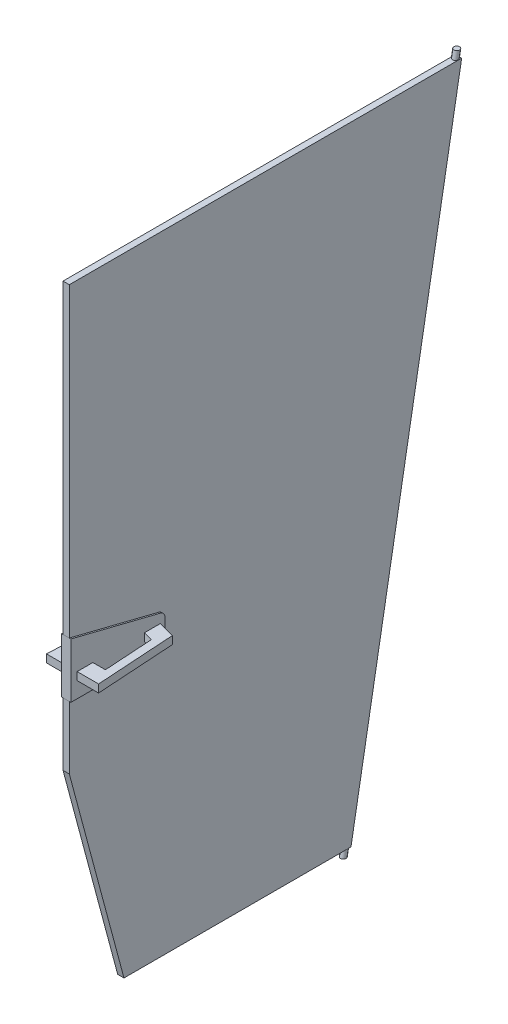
ISO-10303-21;
HEADER;
FILE_DESCRIPTION(('STEP AP214'),'2;1');
FILE_NAME('part.step','',(''),(''),'','','');
FILE_SCHEMA(('AUTOMOTIVE_DESIGN { 1 0 10303 214 1 1 1 1 }'));
ENDSEC;
DATA;
#1=APPLICATION_CONTEXT('core data for automotive mechanical design processes');
#2=APPLICATION_PROTOCOL_DEFINITION('international standard','automotive_design',2000,#1);
#3=PRODUCT_CONTEXT('',#1,'mechanical');
#4=PRODUCT('Part','Part','',(#3));
#5=PRODUCT_RELATED_PRODUCT_CATEGORY('part','',(#4));
#6=PRODUCT_DEFINITION_FORMATION('','',#4);
#7=PRODUCT_DEFINITION_CONTEXT('part definition',#1,'design');
#8=PRODUCT_DEFINITION('design','',#6,#7);
#9=PRODUCT_DEFINITION_SHAPE('','',#8);
#10=(LENGTH_UNIT() NAMED_UNIT(*) SI_UNIT(.MILLI.,.METRE.));
#11=(NAMED_UNIT(*) PLANE_ANGLE_UNIT() SI_UNIT($,.RADIAN.));
#12=(NAMED_UNIT(*) SI_UNIT($,.STERADIAN.) SOLID_ANGLE_UNIT());
#13=UNCERTAINTY_MEASURE_WITH_UNIT(LENGTH_MEASURE(1.E-05),#10,'distance_accuracy_value','');
#14=(GEOMETRIC_REPRESENTATION_CONTEXT(3) GLOBAL_UNCERTAINTY_ASSIGNED_CONTEXT((#13)) GLOBAL_UNIT_ASSIGNED_CONTEXT((#10,
#11,#12)) REPRESENTATION_CONTEXT('',''));
#15=CARTESIAN_POINT('',(0.,0.,0.));
#16=DIRECTION('',(0.,0.,1.));
#17=DIRECTION('',(1.,0.,0.));
#18=AXIS2_PLACEMENT_3D('',#15,#16,#17);
#19=CARTESIAN_POINT('',(-65.,925.,827.39));
#20=DIRECTION('',(-0.997972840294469,0.,-0.063641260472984));
#21=DIRECTION('',(-0.0636412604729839,0.,0.997972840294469));
#22=AXIS2_PLACEMENT_3D('',#19,#20,#21);
#23=PLANE('',#22);
#24=DIRECTION('',(0.0636412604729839,0.,-0.997972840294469));
#25=VECTOR('',#24,1.);
#26=CARTESIAN_POINT('',(-65.,900.,827.39));
#27=LINE('',#26,#25);
#28=CARTESIAN_POINT('',(-65.,900.,827.39));
#29=VERTEX_POINT('',#28);
#30=CARTESIAN_POINT('',(-55.,900.,670.577763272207));
#31=VERTEX_POINT('',#30);
#32=EDGE_CURVE('E12',#29,#31,#27,.T.);
#33=ORIENTED_EDGE('',*,*,#32,.T.);
#34=DIRECTION('',(0.,-1.,0.));
#35=VECTOR('',#34,1.);
#36=CARTESIAN_POINT('',(-55.,925.,670.577763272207));
#37=LINE('',#36,#35);
#38=CARTESIAN_POINT('',(-55.,925.,670.577763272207));
#39=VERTEX_POINT('',#38);
#40=EDGE_CURVE('E187',#39,#31,#37,.T.);
#41=ORIENTED_EDGE('',*,*,#40,.F.);
#42=DIRECTION('',(0.0636412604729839,0.,-0.997972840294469));
#43=VECTOR('',#42,1.);
#44=CARTESIAN_POINT('',(-65.,925.,827.39));
#45=LINE('',#44,#43);
#46=CARTESIAN_POINT('',(-65.,925.,827.39));
#47=VERTEX_POINT('',#46);
#48=EDGE_CURVE('E55',#47,#39,#45,.T.);
#49=ORIENTED_EDGE('',*,*,#48,.F.);
#50=DIRECTION('',(0.,-1.,0.));
#51=VECTOR('',#50,1.);
#52=CARTESIAN_POINT('',(-65.,925.,827.39));
#53=LINE('',#52,#51);
#54=EDGE_CURVE('E155',#47,#29,#53,.T.);
#55=ORIENTED_EDGE('',*,*,#54,.T.);
#56=EDGE_LOOP('',(#33,#41,#49,#55));
#57=FACE_BOUND('',#56,.T.);
#58=ADVANCED_FACE('F51',(#57),#23,.F.);
#59=CARTESIAN_POINT('',(-55.,925.,670.577763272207));
#60=DIRECTION('',(-0.258819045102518,0.,-0.965925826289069));
#61=DIRECTION('',(-0.965925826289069,0.,0.258819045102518));
#62=AXIS2_PLACEMENT_3D('',#59,#60,#61);
#63=PLANE('',#62);
#64=DIRECTION('',(0.965925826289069,0.,-0.258819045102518));
#65=VECTOR('',#64,1.);
#66=CARTESIAN_POINT('',(-55.,900.,670.577763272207));
#67=LINE('',#66,#65);
#68=CARTESIAN_POINT('',(-25.,900.,662.539287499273));
#69=VERTEX_POINT('',#68);
#70=EDGE_CURVE('E61',#31,#69,#67,.T.);
#71=ORIENTED_EDGE('',*,*,#70,.T.);
#72=DIRECTION('',(0.,-1.,0.));
#73=VECTOR('',#72,1.);
#74=CARTESIAN_POINT('',(-25.,925.,662.539287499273));
#75=LINE('',#74,#73);
#76=CARTESIAN_POINT('',(-25.,925.,662.539287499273));
#77=VERTEX_POINT('',#76);
#78=EDGE_CURVE('E131',#77,#69,#75,.T.);
#79=ORIENTED_EDGE('',*,*,#78,.F.);
#80=DIRECTION('',(0.965925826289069,0.,-0.258819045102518));
#81=VECTOR('',#80,1.);
#82=CARTESIAN_POINT('',(-55.,925.,670.577763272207));
#83=LINE('',#82,#81);
#84=EDGE_CURVE('E97',#39,#77,#83,.T.);
#85=ORIENTED_EDGE('',*,*,#84,.F.);
#86=ORIENTED_EDGE('',*,*,#40,.T.);
#87=EDGE_LOOP('',(#71,#79,#85,#86));
#88=FACE_BOUND('',#87,.T.);
#89=ADVANCED_FACE('F193',(#88),#63,.F.);
#90=CARTESIAN_POINT('',(-25.,925.,662.539287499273));
#91=DIRECTION('',(-1.,0.,0.));
#92=DIRECTION('',(0.,0.,1.));
#93=AXIS2_PLACEMENT_3D('',#90,#91,#92);
#94=PLANE('',#93);
#95=DIRECTION('',(0.,0.,-1.));
#96=VECTOR('',#95,1.);
#97=CARTESIAN_POINT('',(-25.,900.,662.539287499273));
#98=LINE('',#97,#96);
#99=CARTESIAN_POINT('',(-25.,900.,612.539287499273));
#100=VERTEX_POINT('',#99);
#101=EDGE_CURVE('E125',#69,#100,#98,.T.);
#102=ORIENTED_EDGE('',*,*,#101,.T.);
#103=DIRECTION('',(0.,-1.,0.));
#104=VECTOR('',#103,1.);
#105=CARTESIAN_POINT('',(-25.,925.,612.539287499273));
#106=LINE('',#105,#104);
#107=CARTESIAN_POINT('',(-25.,925.,612.539287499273));
#108=VERTEX_POINT('',#107);
#109=EDGE_CURVE('E129',#108,#100,#106,.T.);
#110=ORIENTED_EDGE('',*,*,#109,.F.);
#111=DIRECTION('',(0.,0.,-1.));
#112=VECTOR('',#111,1.);
#113=CARTESIAN_POINT('',(-25.,925.,662.539287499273));
#114=LINE('',#113,#112);
#115=EDGE_CURVE('E162',#77,#108,#114,.T.);
#116=ORIENTED_EDGE('',*,*,#115,.F.);
#117=ORIENTED_EDGE('',*,*,#78,.T.);
#118=EDGE_LOOP('',(#102,#110,#116,#117));
#119=FACE_BOUND('',#118,.T.);
#120=ADVANCED_FACE('F127',(#119),#94,.F.);
#121=CARTESIAN_POINT('',(-25.,925.,612.539287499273));
#122=DIRECTION('',(0.258819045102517,0.,0.965925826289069));
#123=DIRECTION('',(0.96592582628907,0.,-0.258819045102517));
#124=AXIS2_PLACEMENT_3D('',#121,#122,#123);
#125=PLANE('',#124);
#126=DIRECTION('',(-0.965925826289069,0.,0.258819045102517));
#127=VECTOR('',#126,1.);
#128=CARTESIAN_POINT('',(-25.,900.,612.539287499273));
#129=LINE('',#128,#127);
#130=CARTESIAN_POINT('',(-77.2423155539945,900.,626.537573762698));
#131=VERTEX_POINT('',#130);
#132=EDGE_CURVE('E133',#100,#131,#129,.T.);
#133=ORIENTED_EDGE('',*,*,#132,.T.);
#134=DIRECTION('',(0.,-1.,0.));
#135=VECTOR('',#134,1.);
#136=CARTESIAN_POINT('',(-77.2423155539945,925.,626.537573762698));
#137=LINE('',#136,#135);
#138=CARTESIAN_POINT('',(-77.2423155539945,925.,626.537573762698));
#139=VERTEX_POINT('',#138);
#140=EDGE_CURVE('E140',#139,#131,#137,.T.);
#141=ORIENTED_EDGE('',*,*,#140,.F.);
#142=DIRECTION('',(-0.965925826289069,0.,0.258819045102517));
#143=VECTOR('',#142,1.);
#144=CARTESIAN_POINT('',(-25.,925.,612.539287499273));
#145=LINE('',#144,#143);
#146=EDGE_CURVE('E139',#108,#139,#145,.T.);
#147=ORIENTED_EDGE('',*,*,#146,.F.);
#148=ORIENTED_EDGE('',*,*,#109,.T.);
#149=EDGE_LOOP('',(#133,#141,#147,#148));
#150=FACE_BOUND('',#149,.T.);
#151=ADVANCED_FACE('F136',(#150),#125,.F.);
#152=CARTESIAN_POINT('',(-77.2423155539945,925.,626.537573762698));
#153=DIRECTION('',(0.997972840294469,0.,0.063641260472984));
#154=DIRECTION('',(0.063641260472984,0.,-0.997972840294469));
#155=AXIS2_PLACEMENT_3D('',#152,#153,#154);
#156=PLANE('',#155);
#157=DIRECTION('',(-0.063641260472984,0.,0.997972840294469));
#158=VECTOR('',#157,1.);
#159=CARTESIAN_POINT('',(-77.2423155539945,900.,626.537573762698));
#160=LINE('',#159,#158);
#161=CARTESIAN_POINT('',(-93.2393086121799,900.,877.39));
#162=VERTEX_POINT('',#161);
#163=EDGE_CURVE('E145',#131,#162,#160,.T.);
#164=ORIENTED_EDGE('',*,*,#163,.T.);
#165=DIRECTION('',(0.,-1.,0.));
#166=VECTOR('',#165,1.);
#167=CARTESIAN_POINT('',(-93.2393086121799,925.,877.39));
#168=LINE('',#167,#166);
#169=CARTESIAN_POINT('',(-93.2393086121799,925.,877.39));
#170=VERTEX_POINT('',#169);
#171=EDGE_CURVE('E179',#170,#162,#168,.T.);
#172=ORIENTED_EDGE('',*,*,#171,.F.);
#173=DIRECTION('',(-0.063641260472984,0.,0.997972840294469));
#174=VECTOR('',#173,1.);
#175=CARTESIAN_POINT('',(-77.2423155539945,925.,626.537573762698));
#176=LINE('',#175,#174);
#177=EDGE_CURVE('E159',#139,#170,#176,.T.);
#178=ORIENTED_EDGE('',*,*,#177,.F.);
#179=ORIENTED_EDGE('',*,*,#140,.T.);
#180=EDGE_LOOP('',(#164,#172,#178,#179));
#181=FACE_BOUND('',#180,.T.);
#182=ADVANCED_FACE('F196',(#181),#156,.F.);
#183=CARTESIAN_POINT('',(-93.2393086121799,925.,877.39));
#184=DIRECTION('',(0.,0.,-1.));
#185=DIRECTION('',(-1.,0.,0.));
#186=AXIS2_PLACEMENT_3D('',#183,#184,#185);
#187=PLANE('',#186);
#188=DIRECTION('',(1.,0.,0.));
#189=VECTOR('',#188,1.);
#190=CARTESIAN_POINT('',(-93.2393086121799,900.,877.39));
#191=LINE('',#190,#189);
#192=CARTESIAN_POINT('',(-25.,900.,877.39));
#193=VERTEX_POINT('',#192);
#194=EDGE_CURVE('E147',#162,#193,#191,.T.);
#195=ORIENTED_EDGE('',*,*,#194,.T.);
#196=DIRECTION('',(0.,-1.,0.));
#197=VECTOR('',#196,1.);
#198=CARTESIAN_POINT('',(-25.,925.,877.39));
#199=LINE('',#198,#197);
#200=CARTESIAN_POINT('',(-25.,925.,877.39));
#201=VERTEX_POINT('',#200);
#202=EDGE_CURVE('E176',#201,#193,#199,.T.);
#203=ORIENTED_EDGE('',*,*,#202,.F.);
#204=DIRECTION('',(1.,0.,0.));
#205=VECTOR('',#204,1.);
#206=CARTESIAN_POINT('',(-93.2393086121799,925.,877.39));
#207=LINE('',#206,#205);
#208=EDGE_CURVE('E157',#170,#201,#207,.T.);
#209=ORIENTED_EDGE('',*,*,#208,.F.);
#210=ORIENTED_EDGE('',*,*,#171,.T.);
#211=EDGE_LOOP('',(#195,#203,#209,#210));
#212=FACE_BOUND('',#211,.T.);
#213=ADVANCED_FACE('F174',(#212),#187,.F.);
#214=CARTESIAN_POINT('',(-25.,925.,877.39));
#215=DIRECTION('',(-1.,0.,0.));
#216=DIRECTION('',(0.,0.,1.));
#217=AXIS2_PLACEMENT_3D('',#214,#215,#216);
#218=PLANE('',#217);
#219=DIRECTION('',(0.,0.,-1.));
#220=VECTOR('',#219,1.);
#221=CARTESIAN_POINT('',(-25.,900.,877.39));
#222=LINE('',#221,#220);
#223=CARTESIAN_POINT('',(-25.,900.,827.39));
#224=VERTEX_POINT('',#223);
#225=EDGE_CURVE('E165',#193,#224,#222,.T.);
#226=ORIENTED_EDGE('',*,*,#225,.T.);
#227=DIRECTION('',(0.,-1.,0.));
#228=VECTOR('',#227,1.);
#229=CARTESIAN_POINT('',(-25.,925.,827.39));
#230=LINE('',#229,#228);
#231=CARTESIAN_POINT('',(-25.,925.,827.39));
#232=VERTEX_POINT('',#231);
#233=EDGE_CURVE('E184',#232,#224,#230,.T.);
#234=ORIENTED_EDGE('',*,*,#233,.F.);
#235=DIRECTION('',(0.,0.,-1.));
#236=VECTOR('',#235,1.);
#237=CARTESIAN_POINT('',(-25.,925.,877.39));
#238=LINE('',#237,#236);
#239=EDGE_CURVE('E154',#201,#232,#238,.T.);
#240=ORIENTED_EDGE('',*,*,#239,.F.);
#241=ORIENTED_EDGE('',*,*,#202,.T.);
#242=EDGE_LOOP('',(#226,#234,#240,#241));
#243=FACE_BOUND('',#242,.T.);
#244=ADVANCED_FACE('F182',(#243),#218,.F.);
#245=CARTESIAN_POINT('',(-25.,925.,827.39));
#246=DIRECTION('',(0.,0.,1.));
#247=DIRECTION('',(1.,0.,0.));
#248=AXIS2_PLACEMENT_3D('',#245,#246,#247);
#249=PLANE('',#248);
#250=DIRECTION('',(-1.,0.,0.));
#251=VECTOR('',#250,1.);
#252=CARTESIAN_POINT('',(-25.,900.,827.39));
#253=LINE('',#252,#251);
#254=EDGE_CURVE('E108',#224,#29,#253,.T.);
#255=ORIENTED_EDGE('',*,*,#254,.T.);
#256=ORIENTED_EDGE('',*,*,#54,.F.);
#257=DIRECTION('',(-1.,0.,0.));
#258=VECTOR('',#257,1.);
#259=CARTESIAN_POINT('',(-25.,925.,827.39));
#260=LINE('',#259,#258);
#261=EDGE_CURVE('E152',#232,#47,#260,.T.);
#262=ORIENTED_EDGE('',*,*,#261,.F.);
#263=ORIENTED_EDGE('',*,*,#233,.T.);
#264=EDGE_LOOP('',(#255,#256,#262,#263));
#265=FACE_BOUND('',#264,.T.);
#266=ADVANCED_FACE('F197',(#265),#249,.F.);
#267=CARTESIAN_POINT('',(0.,925.,0.));
#268=DIRECTION('',(0.,-1.,0.));
#269=DIRECTION('',(0.,0.,-1.));
#270=AXIS2_PLACEMENT_3D('',#267,#268,#269);
#271=PLANE('',#270);
#272=ORIENTED_EDGE('',*,*,#48,.T.);
#273=ORIENTED_EDGE('',*,*,#84,.T.);
#274=ORIENTED_EDGE('',*,*,#115,.T.);
#275=ORIENTED_EDGE('',*,*,#146,.T.);
#276=ORIENTED_EDGE('',*,*,#177,.T.);
#277=ORIENTED_EDGE('',*,*,#208,.T.);
#278=ORIENTED_EDGE('',*,*,#239,.T.);
#279=ORIENTED_EDGE('',*,*,#261,.T.);
#280=EDGE_LOOP('',(#272,#273,#274,#275,#276,#277,#278,#279));
#281=FACE_BOUND('',#280,.T.);
#282=ADVANCED_FACE('F53',(#281),#271,.F.);
#283=CARTESIAN_POINT('',(0.,900.,0.));
#284=DIRECTION('',(0.,-1.,0.));
#285=DIRECTION('',(0.,0.,-1.));
#286=AXIS2_PLACEMENT_3D('',#283,#284,#285);
#287=PLANE('',#286);
#288=ORIENTED_EDGE('',*,*,#32,.F.);
#289=ORIENTED_EDGE('',*,*,#254,.F.);
#290=ORIENTED_EDGE('',*,*,#225,.F.);
#291=ORIENTED_EDGE('',*,*,#194,.F.);
#292=ORIENTED_EDGE('',*,*,#163,.F.);
#293=ORIENTED_EDGE('',*,*,#132,.F.);
#294=ORIENTED_EDGE('',*,*,#101,.F.);
#295=ORIENTED_EDGE('',*,*,#70,.F.);
#296=EDGE_LOOP('',(#288,#289,#290,#291,#292,#293,#294,#295));
#297=FACE_BOUND('',#296,.T.);
#298=ADVANCED_FACE('F143',(#297),#287,.T.);
#299=CLOSED_SHELL('',(#58,#89,#120,#151,#182,#213,#244,#266,#282,#298));
#300=MANIFOLD_SOLID_BREP('B2',#299);
#301=CARTESIAN_POINT('',(35.,925.,670.577763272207));
#302=DIRECTION('',(0.258819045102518,0.,-0.965925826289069));
#303=DIRECTION('',(-0.965925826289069,0.,-0.258819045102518));
#304=AXIS2_PLACEMENT_3D('',#301,#302,#303);
#305=PLANE('',#304);
#306=DIRECTION('',(0.965925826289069,0.,0.258819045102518));
#307=VECTOR('',#306,1.);
#308=CARTESIAN_POINT('',(35.,900.,670.577763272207));
#309=LINE('',#308,#307);
#310=CARTESIAN_POINT('',(5.,900.,662.539287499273));
#311=VERTEX_POINT('',#310);
#312=CARTESIAN_POINT('',(35.,900.,670.577763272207));
#313=VERTEX_POINT('',#312);
#314=EDGE_CURVE('E404',#311,#313,#309,.T.);
#315=ORIENTED_EDGE('',*,*,#314,.T.);
#316=DIRECTION('',(0.,-1.,0.));
#317=VECTOR('',#316,1.);
#318=CARTESIAN_POINT('',(35.,925.,670.577763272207));
#319=LINE('',#318,#317);
#320=CARTESIAN_POINT('',(35.,925.,670.577763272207));
#321=VERTEX_POINT('',#320);
#322=EDGE_CURVE('E49',#321,#313,#319,.T.);
#323=ORIENTED_EDGE('',*,*,#322,.F.);
#324=DIRECTION('',(0.965925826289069,0.,0.258819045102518));
#325=VECTOR('',#324,1.);
#326=CARTESIAN_POINT('',(35.,925.,670.577763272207));
#327=LINE('',#326,#325);
#328=CARTESIAN_POINT('',(5.,925.,662.539287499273));
#329=VERTEX_POINT('',#328);
#330=EDGE_CURVE('E418',#329,#321,#327,.T.);
#331=ORIENTED_EDGE('',*,*,#330,.F.);
#332=DIRECTION('',(0.,-1.,0.));
#333=VECTOR('',#332,1.);
#334=CARTESIAN_POINT('',(5.,925.,662.539287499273));
#335=LINE('',#334,#333);
#336=EDGE_CURVE('E400',#329,#311,#335,.T.);
#337=ORIENTED_EDGE('',*,*,#336,.T.);
#338=EDGE_LOOP('',(#315,#323,#331,#337));
#339=FACE_BOUND('',#338,.T.);
#340=ADVANCED_FACE('F308',(#339),#305,.F.);
#341=CARTESIAN_POINT('',(45.,925.,827.39));
#342=DIRECTION('',(0.997972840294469,0.,-0.0636412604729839));
#343=DIRECTION('',(-0.0636412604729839,0.,-0.997972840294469));
#344=AXIS2_PLACEMENT_3D('',#341,#342,#343);
#345=PLANE('',#344);
#346=DIRECTION('',(0.0636412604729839,0.,0.997972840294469));
#347=VECTOR('',#346,1.);
#348=CARTESIAN_POINT('',(45.,900.,827.39));
#349=LINE('',#348,#347);
#350=CARTESIAN_POINT('',(45.,900.,827.39));
#351=VERTEX_POINT('',#350);
#352=EDGE_CURVE('E407',#313,#351,#349,.T.);
#353=ORIENTED_EDGE('',*,*,#352,.T.);
#354=DIRECTION('',(0.,-1.,0.));
#355=VECTOR('',#354,1.);
#356=CARTESIAN_POINT('',(45.,925.,827.39));
#357=LINE('',#356,#355);
#358=CARTESIAN_POINT('',(45.,925.,827.39));
#359=VERTEX_POINT('',#358);
#360=EDGE_CURVE('E316',#359,#351,#357,.T.);
#361=ORIENTED_EDGE('',*,*,#360,.F.);
#362=DIRECTION('',(0.0636412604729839,0.,0.997972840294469));
#363=VECTOR('',#362,1.);
#364=CARTESIAN_POINT('',(45.,925.,827.39));
#365=LINE('',#364,#363);
#366=EDGE_CURVE('E367',#321,#359,#365,.T.);
#367=ORIENTED_EDGE('',*,*,#366,.F.);
#368=ORIENTED_EDGE('',*,*,#322,.T.);
#369=EDGE_LOOP('',(#353,#361,#367,#368));
#370=FACE_BOUND('',#369,.T.);
#371=ADVANCED_FACE('F453',(#370),#345,.F.);
#372=CARTESIAN_POINT('',(4.99999999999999,925.,827.39));
#373=DIRECTION('',(0.,0.,1.));
#374=DIRECTION('',(1.,0.,0.));
#375=AXIS2_PLACEMENT_3D('',#372,#373,#374);
#376=PLANE('',#375);
#377=DIRECTION('',(-1.,0.,0.));
#378=VECTOR('',#377,1.);
#379=CARTESIAN_POINT('',(4.99999999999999,900.,827.39));
#380=LINE('',#379,#378);
#381=CARTESIAN_POINT('',(4.99999999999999,900.,827.39));
#382=VERTEX_POINT('',#381);
#383=EDGE_CURVE('E409',#351,#382,#380,.T.);
#384=ORIENTED_EDGE('',*,*,#383,.T.);
#385=DIRECTION('',(0.,-1.,0.));
#386=VECTOR('',#385,1.);
#387=CARTESIAN_POINT('',(4.99999999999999,925.,827.39));
#388=LINE('',#387,#386);
#389=CARTESIAN_POINT('',(4.99999999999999,925.,827.39));
#390=VERTEX_POINT('',#389);
#391=EDGE_CURVE('E425',#390,#382,#388,.T.);
#392=ORIENTED_EDGE('',*,*,#391,.F.);
#393=DIRECTION('',(-1.,0.,0.));
#394=VECTOR('',#393,1.);
#395=CARTESIAN_POINT('',(4.99999999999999,925.,827.39));
#396=LINE('',#395,#394);
#397=EDGE_CURVE('E433',#359,#390,#396,.T.);
#398=ORIENTED_EDGE('',*,*,#397,.F.);
#399=ORIENTED_EDGE('',*,*,#360,.T.);
#400=EDGE_LOOP('',(#384,#392,#398,#399));
#401=FACE_BOUND('',#400,.T.);
#402=ADVANCED_FACE('F431',(#401),#376,.F.);
#403=CARTESIAN_POINT('',(5.,925.,877.39));
#404=DIRECTION('',(1.,0.,0.));
#405=DIRECTION('',(0.,0.,-1.));
#406=AXIS2_PLACEMENT_3D('',#403,#404,#405);
#407=PLANE('',#406);
#408=DIRECTION('',(0.,0.,1.));
#409=VECTOR('',#408,1.);
#410=CARTESIAN_POINT('',(5.,900.,877.39));
#411=LINE('',#410,#409);
#412=CARTESIAN_POINT('',(5.,900.,877.39));
#413=VERTEX_POINT('',#412);
#414=EDGE_CURVE('E411',#382,#413,#411,.T.);
#415=ORIENTED_EDGE('',*,*,#414,.T.);
#416=DIRECTION('',(0.,-1.,0.));
#417=VECTOR('',#416,1.);
#418=CARTESIAN_POINT('',(5.,925.,877.39));
#419=LINE('',#418,#417);
#420=CARTESIAN_POINT('',(5.,925.,877.39));
#421=VERTEX_POINT('',#420);
#422=EDGE_CURVE('E422',#421,#413,#419,.T.);
#423=ORIENTED_EDGE('',*,*,#422,.F.);
#424=DIRECTION('',(0.,0.,1.));
#425=VECTOR('',#424,1.);
#426=CARTESIAN_POINT('',(5.,925.,877.39));
#427=LINE('',#426,#425);
#428=EDGE_CURVE('E445',#390,#421,#427,.T.);
#429=ORIENTED_EDGE('',*,*,#428,.F.);
#430=ORIENTED_EDGE('',*,*,#391,.T.);
#431=EDGE_LOOP('',(#415,#423,#429,#430));
#432=FACE_BOUND('',#431,.T.);
#433=ADVANCED_FACE('F441',(#432),#407,.F.);
#434=CARTESIAN_POINT('',(73.2393086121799,925.,877.39));
#435=DIRECTION('',(0.,0.,-1.));
#436=DIRECTION('',(-1.,0.,0.));
#437=AXIS2_PLACEMENT_3D('',#434,#435,#436);
#438=PLANE('',#437);
#439=DIRECTION('',(1.,0.,0.));
#440=VECTOR('',#439,1.);
#441=CARTESIAN_POINT('',(73.2393086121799,900.,877.39));
#442=LINE('',#441,#440);
#443=CARTESIAN_POINT('',(73.2393086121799,900.,877.39));
#444=VERTEX_POINT('',#443);
#445=EDGE_CURVE('E413',#413,#444,#442,.T.);
#446=ORIENTED_EDGE('',*,*,#445,.T.);
#447=DIRECTION('',(0.,-1.,0.));
#448=VECTOR('',#447,1.);
#449=CARTESIAN_POINT('',(73.2393086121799,925.,877.39));
#450=LINE('',#449,#448);
#451=CARTESIAN_POINT('',(73.2393086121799,925.,877.39));
#452=VERTEX_POINT('',#451);
#453=EDGE_CURVE('E395',#452,#444,#450,.T.);
#454=ORIENTED_EDGE('',*,*,#453,.F.);
#455=DIRECTION('',(1.,0.,0.));
#456=VECTOR('',#455,1.);
#457=CARTESIAN_POINT('',(73.2393086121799,925.,877.39));
#458=LINE('',#457,#456);
#459=EDGE_CURVE('E386',#421,#452,#458,.T.);
#460=ORIENTED_EDGE('',*,*,#459,.F.);
#461=ORIENTED_EDGE('',*,*,#422,.T.);
#462=EDGE_LOOP('',(#446,#454,#460,#461));
#463=FACE_BOUND('',#462,.T.);
#464=ADVANCED_FACE('F444',(#463),#438,.F.);
#465=CARTESIAN_POINT('',(57.2423155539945,925.,626.537573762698));
#466=DIRECTION('',(-0.997972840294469,0.,0.063641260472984));
#467=DIRECTION('',(0.063641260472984,0.,0.997972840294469));
#468=AXIS2_PLACEMENT_3D('',#465,#466,#467);
#469=PLANE('',#468);
#470=DIRECTION('',(-0.063641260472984,0.,-0.997972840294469));
#471=VECTOR('',#470,1.);
#472=CARTESIAN_POINT('',(57.2423155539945,900.,626.537573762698));
#473=LINE('',#472,#471);
#474=CARTESIAN_POINT('',(57.2423155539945,900.,626.537573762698));
#475=VERTEX_POINT('',#474);
#476=EDGE_CURVE('E394',#444,#475,#473,.T.);
#477=ORIENTED_EDGE('',*,*,#476,.T.);
#478=DIRECTION('',(0.,-1.,0.));
#479=VECTOR('',#478,1.);
#480=CARTESIAN_POINT('',(57.2423155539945,925.,626.537573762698));
#481=LINE('',#480,#479);
#482=CARTESIAN_POINT('',(57.2423155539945,925.,626.537573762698));
#483=VERTEX_POINT('',#482);
#484=EDGE_CURVE('E391',#483,#475,#481,.T.);
#485=ORIENTED_EDGE('',*,*,#484,.F.);
#486=DIRECTION('',(-0.063641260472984,0.,-0.997972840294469));
#487=VECTOR('',#486,1.);
#488=CARTESIAN_POINT('',(57.2423155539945,925.,626.537573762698));
#489=LINE('',#488,#487);
#490=EDGE_CURVE('E380',#452,#483,#489,.T.);
#491=ORIENTED_EDGE('',*,*,#490,.F.);
#492=ORIENTED_EDGE('',*,*,#453,.T.);
#493=EDGE_LOOP('',(#477,#485,#491,#492));
#494=FACE_BOUND('',#493,.T.);
#495=ADVANCED_FACE('F392',(#494),#469,.F.);
#496=CARTESIAN_POINT('',(5.,925.,612.539287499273));
#497=DIRECTION('',(-0.258819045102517,0.,0.965925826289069));
#498=DIRECTION('',(0.96592582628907,0.,0.258819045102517));
#499=AXIS2_PLACEMENT_3D('',#496,#497,#498);
#500=PLANE('',#499);
#501=DIRECTION('',(-0.965925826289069,0.,-0.258819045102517));
#502=VECTOR('',#501,1.);
#503=CARTESIAN_POINT('',(5.,900.,612.539287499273));
#504=LINE('',#503,#502);
#505=CARTESIAN_POINT('',(5.,900.,612.539287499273));
#506=VERTEX_POINT('',#505);
#507=EDGE_CURVE('E353',#475,#506,#504,.T.);
#508=ORIENTED_EDGE('',*,*,#507,.T.);
#509=DIRECTION('',(0.,-1.,0.));
#510=VECTOR('',#509,1.);
#511=CARTESIAN_POINT('',(5.,925.,612.539287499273));
#512=LINE('',#511,#510);
#513=CARTESIAN_POINT('',(5.,925.,612.539287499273));
#514=VERTEX_POINT('',#513);
#515=EDGE_CURVE('E396',#514,#506,#512,.T.);
#516=ORIENTED_EDGE('',*,*,#515,.F.);
#517=DIRECTION('',(-0.965925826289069,0.,-0.258819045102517));
#518=VECTOR('',#517,1.);
#519=CARTESIAN_POINT('',(5.,925.,612.539287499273));
#520=LINE('',#519,#518);
#521=EDGE_CURVE('E384',#483,#514,#520,.T.);
#522=ORIENTED_EDGE('',*,*,#521,.F.);
#523=ORIENTED_EDGE('',*,*,#484,.T.);
#524=EDGE_LOOP('',(#508,#516,#522,#523));
#525=FACE_BOUND('',#524,.T.);
#526=ADVANCED_FACE('F398',(#525),#500,.F.);
#527=CARTESIAN_POINT('',(5.,925.,662.539287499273));
#528=DIRECTION('',(1.,0.,0.));
#529=DIRECTION('',(0.,0.,-1.));
#530=AXIS2_PLACEMENT_3D('',#527,#528,#529);
#531=PLANE('',#530);
#532=DIRECTION('',(0.,0.,1.));
#533=VECTOR('',#532,1.);
#534=CARTESIAN_POINT('',(5.,900.,662.539287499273));
#535=LINE('',#534,#533);
#536=EDGE_CURVE('E359',#506,#311,#535,.T.);
#537=ORIENTED_EDGE('',*,*,#536,.T.);
#538=ORIENTED_EDGE('',*,*,#336,.F.);
#539=DIRECTION('',(0.,0.,1.));
#540=VECTOR('',#539,1.);
#541=CARTESIAN_POINT('',(5.,925.,662.539287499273));
#542=LINE('',#541,#540);
#543=EDGE_CURVE('E324',#514,#329,#542,.T.);
#544=ORIENTED_EDGE('',*,*,#543,.F.);
#545=ORIENTED_EDGE('',*,*,#515,.T.);
#546=EDGE_LOOP('',(#537,#538,#544,#545));
#547=FACE_BOUND('',#546,.T.);
#548=ADVANCED_FACE('F469',(#547),#531,.F.);
#549=CARTESIAN_POINT('',(0.,925.,0.));
#550=DIRECTION('',(0.,-1.,0.));
#551=DIRECTION('',(0.,0.,-1.));
#552=AXIS2_PLACEMENT_3D('',#549,#550,#551);
#553=PLANE('',#552);
#554=ORIENTED_EDGE('',*,*,#330,.T.);
#555=ORIENTED_EDGE('',*,*,#366,.T.);
#556=ORIENTED_EDGE('',*,*,#397,.T.);
#557=ORIENTED_EDGE('',*,*,#428,.T.);
#558=ORIENTED_EDGE('',*,*,#459,.T.);
#559=ORIENTED_EDGE('',*,*,#490,.T.);
#560=ORIENTED_EDGE('',*,*,#521,.T.);
#561=ORIENTED_EDGE('',*,*,#543,.T.);
#562=EDGE_LOOP('',(#554,#555,#556,#557,#558,#559,#560,#561));
#563=FACE_BOUND('',#562,.T.);
#564=ADVANCED_FACE('F382',(#563),#553,.F.);
#565=CARTESIAN_POINT('',(0.,900.,0.));
#566=DIRECTION('',(0.,-1.,0.));
#567=DIRECTION('',(0.,0.,-1.));
#568=AXIS2_PLACEMENT_3D('',#565,#566,#567);
#569=PLANE('',#568);
#570=ORIENTED_EDGE('',*,*,#314,.F.);
#571=ORIENTED_EDGE('',*,*,#536,.F.);
#572=ORIENTED_EDGE('',*,*,#507,.F.);
#573=ORIENTED_EDGE('',*,*,#476,.F.);
#574=ORIENTED_EDGE('',*,*,#445,.F.);
#575=ORIENTED_EDGE('',*,*,#414,.F.);
#576=ORIENTED_EDGE('',*,*,#383,.F.);
#577=ORIENTED_EDGE('',*,*,#352,.F.);
#578=EDGE_LOOP('',(#570,#571,#572,#573,#574,#575,#576,#577));
#579=FACE_BOUND('',#578,.T.);
#580=ADVANCED_FACE('F437',(#579),#569,.T.);
#581=CLOSED_SHELL('',(#340,#371,#402,#433,#464,#495,#526,#548,#564,#580));
#582=MANIFOLD_SOLID_BREP('B6',#581);
#583=CARTESIAN_POINT('',(-25.,1025.,897.39));
#584=DIRECTION('',(0.,0.,1.));
#585=DIRECTION('',(1.,0.,0.));
#586=AXIS2_PLACEMENT_3D('',#583,#584,#585);
#587=PLANE('',#586);
#588=DIRECTION('',(1.,0.,0.));
#589=VECTOR('',#588,1.);
#590=CARTESIAN_POINT('',(-25.,850.,897.39));
#591=LINE('',#590,#589);
#592=CARTESIAN_POINT('',(-25.,850.,897.39));
#593=VERTEX_POINT('',#592);
#594=CARTESIAN_POINT('',(5.,850.,897.39));
#595=VERTEX_POINT('',#594);
#596=EDGE_CURVE('E568',#593,#595,#591,.T.);
#597=ORIENTED_EDGE('',*,*,#596,.T.);
#598=DIRECTION('',(0.,-1.,0.));
#599=VECTOR('',#598,1.);
#600=CARTESIAN_POINT('',(5.,1025.,897.39));
#601=LINE('',#600,#599);
#602=CARTESIAN_POINT('',(5.,1025.,897.39));
#603=VERTEX_POINT('',#602);
#604=EDGE_CURVE('E617',#603,#595,#601,.T.);
#605=ORIENTED_EDGE('',*,*,#604,.F.);
#606=DIRECTION('',(1.,0.,0.));
#607=VECTOR('',#606,1.);
#608=CARTESIAN_POINT('',(-25.,1025.,897.39));
#609=LINE('',#608,#607);
#610=CARTESIAN_POINT('',(-25.,1025.,897.39));
#611=VERTEX_POINT('',#610);
#612=EDGE_CURVE('E306',#611,#603,#609,.T.);
#613=ORIENTED_EDGE('',*,*,#612,.F.);
#614=DIRECTION('',(0.,-1.,0.));
#615=VECTOR('',#614,1.);
#616=CARTESIAN_POINT('',(-25.,1025.,897.39));
#617=LINE('',#616,#615);
#618=EDGE_CURVE('E618',#611,#593,#617,.T.);
#619=ORIENTED_EDGE('',*,*,#618,.T.);
#620=EDGE_LOOP('',(#597,#605,#613,#619));
#621=FACE_BOUND('',#620,.T.);
#622=ADVANCED_FACE('F565',(#621),#587,.T.);
#623=CARTESIAN_POINT('',(-25.,953.787321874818,612.539287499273));
#624=DIRECTION('',(0.,0.970142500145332,-0.242535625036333));
#625=DIRECTION('',(0.,0.242535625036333,0.970142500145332));
#626=AXIS2_PLACEMENT_3D('',#623,#624,#625);
#627=PLANE('',#626);
#628=ORIENTED_EDGE('',*,*,#612,.T.);
#629=DIRECTION('',(0.,0.242535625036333,0.970142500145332));
#630=VECTOR('',#629,1.);
#631=CARTESIAN_POINT('',(5.,953.787321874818,612.539287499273));
#632=LINE('',#631,#630);
#633=CARTESIAN_POINT('',(5.,953.787321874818,612.539287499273));
#634=VERTEX_POINT('',#633);
#635=EDGE_CURVE('E635',#634,#603,#632,.T.);
#636=ORIENTED_EDGE('',*,*,#635,.F.);
#637=DIRECTION('',(1.,0.,0.));
#638=VECTOR('',#637,1.);
#639=CARTESIAN_POINT('',(-25.,953.787321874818,612.539287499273));
#640=LINE('',#639,#638);
#641=CARTESIAN_POINT('',(-25.,953.787321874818,612.539287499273));
#642=VERTEX_POINT('',#641);
#643=EDGE_CURVE('E573',#642,#634,#640,.T.);
#644=ORIENTED_EDGE('',*,*,#643,.F.);
#645=DIRECTION('',(0.,0.242535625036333,0.970142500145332));
#646=VECTOR('',#645,1.);
#647=CARTESIAN_POINT('',(-25.,953.787321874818,612.539287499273));
#648=LINE('',#647,#646);
#649=EDGE_CURVE('E623',#642,#611,#648,.T.);
#650=ORIENTED_EDGE('',*,*,#649,.T.);
#651=EDGE_LOOP('',(#628,#636,#644,#650));
#652=FACE_BOUND('',#651,.T.);
#653=ADVANCED_FACE('F675',(#652),#627,.T.);
#654=CARTESIAN_POINT('',(-25.,934.384471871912,617.39));
#655=DIRECTION('',(1.,0.,0.));
#656=DIRECTION('',(0.,0.,-1.));
#657=AXIS2_PLACEMENT_3D('',#654,#655,#656);
#658=CYLINDRICAL_SURFACE('',#657,20.);
#659=ORIENTED_EDGE('',*,*,#643,.T.);
#660=CARTESIAN_POINT('',(5.,934.384471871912,617.39));
#661=DIRECTION('',(1.,0.,0.));
#662=DIRECTION('',(0.,0.,-1.));
#663=AXIS2_PLACEMENT_3D('',#660,#661,#662);
#664=CIRCLE('',#663,20.);
#665=CARTESIAN_POINT('',(5.,934.384471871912,597.39));
#666=VERTEX_POINT('',#665);
#667=EDGE_CURVE('E642',#666,#634,#664,.T.);
#668=ORIENTED_EDGE('',*,*,#667,.F.);
#669=DIRECTION('',(1.,0.,0.));
#670=VECTOR('',#669,1.);
#671=CARTESIAN_POINT('',(-25.,934.384471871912,597.39));
#672=LINE('',#671,#670);
#673=CARTESIAN_POINT('',(-25.,934.384471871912,597.39));
#674=VERTEX_POINT('',#673);
#675=EDGE_CURVE('E658',#674,#666,#672,.T.);
#676=ORIENTED_EDGE('',*,*,#675,.F.);
#677=CARTESIAN_POINT('',(-25.,934.384471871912,617.39));
#678=DIRECTION('',(1.,0.,0.));
#679=DIRECTION('',(0.,0.,-1.));
#680=AXIS2_PLACEMENT_3D('',#677,#678,#679);
#681=CIRCLE('',#680,20.);
#682=EDGE_CURVE('E654',#674,#642,#681,.T.);
#683=ORIENTED_EDGE('',*,*,#682,.T.);
#684=EDGE_LOOP('',(#659,#668,#676,#683));
#685=FACE_BOUND('',#684,.T.);
#686=ADVANCED_FACE('F671',(#685),#658,.T.);
#687=CARTESIAN_POINT('',(-25.,870.,597.39));
#688=DIRECTION('',(0.,0.,-1.));
#689=DIRECTION('',(-1.,0.,0.));
#690=AXIS2_PLACEMENT_3D('',#687,#688,#689);
#691=PLANE('',#690);
#692=ORIENTED_EDGE('',*,*,#675,.T.);
#693=DIRECTION('',(0.,1.,0.));
#694=VECTOR('',#693,1.);
#695=CARTESIAN_POINT('',(5.,870.,597.39));
#696=LINE('',#695,#694);
#697=CARTESIAN_POINT('',(5.,870.,597.39));
#698=VERTEX_POINT('',#697);
#699=EDGE_CURVE('E639',#698,#666,#696,.T.);
#700=ORIENTED_EDGE('',*,*,#699,.F.);
#701=DIRECTION('',(1.,0.,0.));
#702=VECTOR('',#701,1.);
#703=CARTESIAN_POINT('',(-25.,870.,597.39));
#704=LINE('',#703,#702);
#705=CARTESIAN_POINT('',(-25.,870.,597.39));
#706=VERTEX_POINT('',#705);
#707=EDGE_CURVE('E660',#706,#698,#704,.T.);
#708=ORIENTED_EDGE('',*,*,#707,.F.);
#709=DIRECTION('',(0.,1.,0.));
#710=VECTOR('',#709,1.);
#711=CARTESIAN_POINT('',(-25.,870.,597.39));
#712=LINE('',#711,#710);
#713=EDGE_CURVE('E651',#706,#674,#712,.T.);
#714=ORIENTED_EDGE('',*,*,#713,.T.);
#715=EDGE_LOOP('',(#692,#700,#708,#714));
#716=FACE_BOUND('',#715,.T.);
#717=ADVANCED_FACE('F668',(#716),#691,.T.);
#718=CARTESIAN_POINT('',(-25.,870.,617.39));
#719=DIRECTION('',(1.,0.,0.));
#720=DIRECTION('',(0.,0.,-1.));
#721=AXIS2_PLACEMENT_3D('',#718,#719,#720);
#722=CYLINDRICAL_SURFACE('',#721,20.);
#723=ORIENTED_EDGE('',*,*,#707,.T.);
#724=CARTESIAN_POINT('',(5.,870.,617.39));
#725=DIRECTION('',(1.,0.,0.));
#726=DIRECTION('',(0.,0.,-1.));
#727=AXIS2_PLACEMENT_3D('',#724,#725,#726);
#728=CIRCLE('',#727,20.);
#729=CARTESIAN_POINT('',(5.,850.,617.39));
#730=VERTEX_POINT('',#729);
#731=EDGE_CURVE('E630',#730,#698,#728,.T.);
#732=ORIENTED_EDGE('',*,*,#731,.F.);
#733=DIRECTION('',(1.,0.,0.));
#734=VECTOR('',#733,1.);
#735=CARTESIAN_POINT('',(-25.,850.,617.39));
#736=LINE('',#735,#734);
#737=CARTESIAN_POINT('',(-25.,850.,617.39));
#738=VERTEX_POINT('',#737);
#739=EDGE_CURVE('E622',#738,#730,#736,.T.);
#740=ORIENTED_EDGE('',*,*,#739,.F.);
#741=CARTESIAN_POINT('',(-25.,870.,617.39));
#742=DIRECTION('',(1.,0.,0.));
#743=DIRECTION('',(0.,0.,-1.));
#744=AXIS2_PLACEMENT_3D('',#741,#742,#743);
#745=CIRCLE('',#744,20.);
#746=EDGE_CURVE('E648',#738,#706,#745,.T.);
#747=ORIENTED_EDGE('',*,*,#746,.T.);
#748=EDGE_LOOP('',(#723,#732,#740,#747));
#749=FACE_BOUND('',#748,.T.);
#750=ADVANCED_FACE('F662',(#749),#722,.T.);
#751=CARTESIAN_POINT('',(-25.,850.,897.39));
#752=DIRECTION('',(0.,-1.,0.));
#753=DIRECTION('',(0.,0.,-1.));
#754=AXIS2_PLACEMENT_3D('',#751,#752,#753);
#755=PLANE('',#754);
#756=ORIENTED_EDGE('',*,*,#739,.T.);
#757=DIRECTION('',(0.,0.,-1.));
#758=VECTOR('',#757,1.);
#759=CARTESIAN_POINT('',(5.,850.,897.39));
#760=LINE('',#759,#758);
#761=EDGE_CURVE('E625',#595,#730,#760,.T.);
#762=ORIENTED_EDGE('',*,*,#761,.F.);
#763=ORIENTED_EDGE('',*,*,#596,.F.);
#764=DIRECTION('',(0.,0.,-1.));
#765=VECTOR('',#764,1.);
#766=CARTESIAN_POINT('',(-25.,850.,897.39));
#767=LINE('',#766,#765);
#768=EDGE_CURVE('E646',#593,#738,#767,.T.);
#769=ORIENTED_EDGE('',*,*,#768,.T.);
#770=EDGE_LOOP('',(#756,#762,#763,#769));
#771=FACE_BOUND('',#770,.T.);
#772=ADVANCED_FACE('F626',(#771),#755,.T.);
#773=CARTESIAN_POINT('',(-25.,870.,617.39));
#774=DIRECTION('',(1.,0.,0.));
#775=DIRECTION('',(0.,0.,-1.));
#776=AXIS2_PLACEMENT_3D('',#773,#774,#775);
#777=PLANE('',#776);
#778=ORIENTED_EDGE('',*,*,#618,.F.);
#779=ORIENTED_EDGE('',*,*,#649,.F.);
#780=ORIENTED_EDGE('',*,*,#682,.F.);
#781=ORIENTED_EDGE('',*,*,#713,.F.);
#782=ORIENTED_EDGE('',*,*,#746,.F.);
#783=ORIENTED_EDGE('',*,*,#768,.F.);
#784=EDGE_LOOP('',(#778,#779,#780,#781,#782,#783));
#785=FACE_BOUND('',#784,.T.);
#786=ADVANCED_FACE('F674',(#785),#777,.F.);
#787=CARTESIAN_POINT('',(5.,870.,617.39));
#788=DIRECTION('',(1.,0.,0.));
#789=DIRECTION('',(0.,0.,-1.));
#790=AXIS2_PLACEMENT_3D('',#787,#788,#789);
#791=PLANE('',#790);
#792=ORIENTED_EDGE('',*,*,#604,.T.);
#793=ORIENTED_EDGE('',*,*,#761,.T.);
#794=ORIENTED_EDGE('',*,*,#731,.T.);
#795=ORIENTED_EDGE('',*,*,#699,.T.);
#796=ORIENTED_EDGE('',*,*,#667,.T.);
#797=ORIENTED_EDGE('',*,*,#635,.T.);
#798=EDGE_LOOP('',(#792,#793,#794,#795,#796,#797));
#799=FACE_BOUND('',#798,.T.);
#800=ADVANCED_FACE('F633',(#799),#791,.T.);
#801=CLOSED_SHELL('',(#622,#653,#686,#717,#750,#772,#786,#800));
#802=MANIFOLD_SOLID_BREP('B43',#801);
#803=CARTESIAN_POINT('',(-20.,650.,897.39));
#804=DIRECTION('',(0.,0.,1.));
#805=DIRECTION('',(1.,0.,0.));
#806=AXIS2_PLACEMENT_3D('',#803,#804,#805);
#807=PLANE('',#806);
#808=DIRECTION('',(1.,0.,0.));
#809=VECTOR('',#808,1.);
#810=CARTESIAN_POINT('',(-20.,1025.,897.39));
#811=LINE('',#810,#809);
#812=CARTESIAN_POINT('',(-20.,1025.,897.39));
#813=VERTEX_POINT('',#812);
#814=CARTESIAN_POINT('',(0.,1025.,897.39));
#815=VERTEX_POINT('',#814);
#816=EDGE_CURVE('E867',#813,#815,#811,.T.);
#817=ORIENTED_EDGE('',*,*,#816,.T.);
#818=DIRECTION('',(0.,-1.,0.));
#819=VECTOR('',#818,1.);
#820=CARTESIAN_POINT('',(0.,650.,897.39));
#821=LINE('',#820,#819);
#822=CARTESIAN_POINT('',(0.,2000.,897.39));
#823=VERTEX_POINT('',#822);
#824=EDGE_CURVE('E876',#823,#815,#821,.T.);
#825=ORIENTED_EDGE('',*,*,#824,.F.);
#826=DIRECTION('',(1.,0.,0.));
#827=VECTOR('',#826,1.);
#828=CARTESIAN_POINT('',(-20.,2000.,897.39));
#829=LINE('',#828,#827);
#830=CARTESIAN_POINT('',(-20.,2000.,897.39));
#831=VERTEX_POINT('',#830);
#832=EDGE_CURVE('E884',#831,#823,#829,.T.);
#833=ORIENTED_EDGE('',*,*,#832,.F.);
#834=DIRECTION('',(0.,-1.,0.));
#835=VECTOR('',#834,1.);
#836=CARTESIAN_POINT('',(-20.,650.,897.39));
#837=LINE('',#836,#835);
#838=EDGE_CURVE('E919',#831,#813,#837,.T.);
#839=ORIENTED_EDGE('',*,*,#838,.T.);
#840=EDGE_LOOP('',(#817,#825,#833,#839));
#841=FACE_BOUND('',#840,.T.);
#842=ADVANCED_FACE('F757',(#841),#807,.T.);
#843=CARTESIAN_POINT('',(-20.,2000.,-352.66));
#844=DIRECTION('',(0.,-0.173651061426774,-0.984807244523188));
#845=DIRECTION('',(0.,0.984807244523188,-0.173651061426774));
#846=AXIS2_PLACEMENT_3D('',#843,#844,#845);
#847=PLANE('',#846);
#848=DIRECTION('',(0.,0.984807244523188,-0.173651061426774));
#849=VECTOR('',#848,1.);
#850=CARTESIAN_POINT('',(0.,2000.,-352.66));
#851=LINE('',#850,#849);
#852=CARTESIAN_POINT('',(0.,0.,0.));
#853=VERTEX_POINT('',#852);
#854=CARTESIAN_POINT('',(0.,2000.,-352.66));
#855=VERTEX_POINT('',#854);
#856=EDGE_CURVE('E861',#853,#855,#851,.T.);
#857=ORIENTED_EDGE('',*,*,#856,.F.);
#858=DIRECTION('',(1.,0.,0.));
#859=VECTOR('',#858,1.);
#860=CARTESIAN_POINT('',(-20.,0.,0.));
#861=LINE('',#860,#859);
#862=CARTESIAN_POINT('',(-20.,0.,0.));
#863=VERTEX_POINT('',#862);
#864=EDGE_CURVE('E848',#863,#853,#861,.T.);
#865=ORIENTED_EDGE('',*,*,#864,.F.);
#866=DIRECTION('',(0.,0.984807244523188,-0.173651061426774));
#867=VECTOR('',#866,1.);
#868=CARTESIAN_POINT('',(-20.,2000.,-352.66));
#869=LINE('',#868,#867);
#870=CARTESIAN_POINT('',(-20.,2000.,-352.66));
#871=VERTEX_POINT('',#870);
#872=EDGE_CURVE('E872',#863,#871,#869,.T.);
#873=ORIENTED_EDGE('',*,*,#872,.T.);
#874=DIRECTION('',(1.,0.,0.));
#875=VECTOR('',#874,1.);
#876=CARTESIAN_POINT('',(-20.,2000.,-352.66));
#877=LINE('',#876,#875);
#878=EDGE_CURVE('E862',#871,#855,#877,.T.);
#879=ORIENTED_EDGE('',*,*,#878,.T.);
#880=EDGE_LOOP('',(#857,#865,#873,#879));
#881=FACE_BOUND('',#880,.T.);
#882=ADVANCED_FACE('F759',(#881),#847,.T.);
#883=CARTESIAN_POINT('',(-20.,0.,0.));
#884=DIRECTION('',(0.,-1.,0.));
#885=DIRECTION('',(0.,0.,-1.));
#886=AXIS2_PLACEMENT_3D('',#883,#884,#885);
#887=PLANE('',#886);
#888=CARTESIAN_POINT('',(-10.,0.,10.1542713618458));
#889=DIRECTION('',(0.,-1.,0.));
#890=DIRECTION('',(0.,0.,1.));
#891=AXIS2_PLACEMENT_3D('',#888,#889,#890);
#892=ELLIPSE('',#891,9.13884422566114,9.);
#893=CARTESIAN_POINT('',(-10.,0.,19.2931155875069));
#894=VERTEX_POINT('',#893);
#895=EDGE_CURVE('E974',#894,#894,#892,.F.);
#896=ORIENTED_EDGE('',*,*,#895,.T.);
#897=EDGE_LOOP('',(#896));
#898=FACE_BOUND('',#897,.T.);
#899=DIRECTION('',(0.,0.,-1.));
#900=VECTOR('',#899,1.);
#901=CARTESIAN_POINT('',(0.,0.,0.));
#902=LINE('',#901,#900);
#903=CARTESIAN_POINT('',(0.,0.,723.22));
#904=VERTEX_POINT('',#903);
#905=EDGE_CURVE('E852',#904,#853,#902,.T.);
#906=ORIENTED_EDGE('',*,*,#905,.F.);
#907=DIRECTION('',(1.,0.,0.));
#908=VECTOR('',#907,1.);
#909=CARTESIAN_POINT('',(-20.,0.,723.22));
#910=LINE('',#909,#908);
#911=CARTESIAN_POINT('',(-20.,0.,723.22));
#912=VERTEX_POINT('',#911);
#913=EDGE_CURVE('E842',#912,#904,#910,.T.);
#914=ORIENTED_EDGE('',*,*,#913,.F.);
#915=DIRECTION('',(0.,0.,-1.));
#916=VECTOR('',#915,1.);
#917=CARTESIAN_POINT('',(-20.,0.,0.));
#918=LINE('',#917,#916);
#919=EDGE_CURVE('E854',#912,#863,#918,.T.);
#920=ORIENTED_EDGE('',*,*,#919,.T.);
#921=ORIENTED_EDGE('',*,*,#864,.T.);
#922=EDGE_LOOP('',(#906,#914,#920,#921));
#923=FACE_BOUND('',#922,.T.);
#924=ADVANCED_FACE('F850',(#898,#923),#887,.T.);
#925=CARTESIAN_POINT('',(-20.,0.,723.22));
#926=DIRECTION('',(0.,-0.258823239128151,0.965924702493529));
#927=DIRECTION('',(0.,-0.965924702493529,-0.258823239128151));
#928=AXIS2_PLACEMENT_3D('',#925,#926,#927);
#929=PLANE('',#928);
#930=DIRECTION('',(0.,-0.965924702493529,-0.258823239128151));
#931=VECTOR('',#930,1.);
#932=CARTESIAN_POINT('',(0.,0.,723.22));
#933=LINE('',#932,#931);
#934=CARTESIAN_POINT('',(0.,650.,897.39));
#935=VERTEX_POINT('',#934);
#936=EDGE_CURVE('E871',#935,#904,#933,.T.);
#937=ORIENTED_EDGE('',*,*,#936,.F.);
#938=DIRECTION('',(1.,0.,0.));
#939=VECTOR('',#938,1.);
#940=CARTESIAN_POINT('',(-20.,650.,897.39));
#941=LINE('',#940,#939);
#942=CARTESIAN_POINT('',(-20.,650.,897.39));
#943=VERTEX_POINT('',#942);
#944=EDGE_CURVE('E881',#943,#935,#941,.T.);
#945=ORIENTED_EDGE('',*,*,#944,.F.);
#946=DIRECTION('',(0.,-0.965924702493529,-0.258823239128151));
#947=VECTOR('',#946,1.);
#948=CARTESIAN_POINT('',(-20.,0.,723.22));
#949=LINE('',#948,#947);
#950=EDGE_CURVE('E922',#943,#912,#949,.T.);
#951=ORIENTED_EDGE('',*,*,#950,.T.);
#952=ORIENTED_EDGE('',*,*,#913,.T.);
#953=EDGE_LOOP('',(#937,#945,#951,#952));
#954=FACE_BOUND('',#953,.T.);
#955=ADVANCED_FACE('F933',(#954),#929,.T.);
#956=DIRECTION('',(1.,0.,0.));
#957=VECTOR('',#956,1.);
#958=CARTESIAN_POINT('',(-20.,850.,897.39));
#959=LINE('',#958,#957);
#960=CARTESIAN_POINT('',(-20.,850.,897.39));
#961=VERTEX_POINT('',#960);
#962=CARTESIAN_POINT('',(0.,850.,897.39));
#963=VERTEX_POINT('',#962);
#964=EDGE_CURVE('E776',#961,#963,#959,.T.);
#965=ORIENTED_EDGE('',*,*,#964,.F.);
#966=EDGE_CURVE('E918',#961,#943,#837,.T.);
#967=ORIENTED_EDGE('',*,*,#966,.T.);
#968=ORIENTED_EDGE('',*,*,#944,.T.);
#969=EDGE_CURVE('E925',#963,#935,#821,.T.);
#970=ORIENTED_EDGE('',*,*,#969,.F.);
#971=EDGE_LOOP('',(#965,#967,#968,#970));
#972=FACE_BOUND('',#971,.T.);
#973=ADVANCED_FACE('F930',(#972),#807,.T.);
#974=CARTESIAN_POINT('',(-20.,2000.,897.39));
#975=DIRECTION('',(0.,1.,0.));
#976=DIRECTION('',(0.,0.,1.));
#977=AXIS2_PLACEMENT_3D('',#974,#975,#976);
#978=PLANE('',#977);
#979=CARTESIAN_POINT('',(-10.,2000.,-342.505728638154));
#980=DIRECTION('',(0.,1.,0.));
#981=DIRECTION('',(0.,0.,1.));
#982=AXIS2_PLACEMENT_3D('',#979,#980,#981);
#983=ELLIPSE('',#982,9.13884422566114,9.);
#984=CARTESIAN_POINT('',(-10.,2000.,-333.366884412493));
#985=VERTEX_POINT('',#984);
#986=EDGE_CURVE('E761',#985,#985,#983,.F.);
#987=ORIENTED_EDGE('',*,*,#986,.T.);
#988=EDGE_LOOP('',(#987));
#989=FACE_BOUND('',#988,.T.);
#990=DIRECTION('',(0.,0.,1.));
#991=VECTOR('',#990,1.);
#992=CARTESIAN_POINT('',(0.,2000.,897.39));
#993=LINE('',#992,#991);
#994=EDGE_CURVE('E866',#855,#823,#993,.T.);
#995=ORIENTED_EDGE('',*,*,#994,.F.);
#996=ORIENTED_EDGE('',*,*,#878,.F.);
#997=DIRECTION('',(0.,0.,1.));
#998=VECTOR('',#997,1.);
#999=CARTESIAN_POINT('',(-20.,2000.,897.39));
#1000=LINE('',#999,#998);
#1001=EDGE_CURVE('E874',#871,#831,#1000,.T.);
#1002=ORIENTED_EDGE('',*,*,#1001,.T.);
#1003=ORIENTED_EDGE('',*,*,#832,.T.);
#1004=EDGE_LOOP('',(#995,#996,#1002,#1003));
#1005=FACE_BOUND('',#1004,.T.);
#1006=ADVANCED_FACE('F940',(#989,#1005),#978,.T.);
#1007=CARTESIAN_POINT('',(-20.,0.,0.));
#1008=DIRECTION('',(-1.,0.,0.));
#1009=DIRECTION('',(0.,0.,1.));
#1010=AXIS2_PLACEMENT_3D('',#1007,#1008,#1009);
#1011=PLANE('',#1010);
#1012=DIRECTION('',(0.,0.242535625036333,0.970142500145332));
#1013=VECTOR('',#1012,1.);
#1014=CARTESIAN_POINT('',(-20.,953.787321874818,612.539287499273));
#1015=LINE('',#1014,#1013);
#1016=CARTESIAN_POINT('',(-20.,953.787321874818,612.539287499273));
#1017=VERTEX_POINT('',#1016);
#1018=EDGE_CURVE('E965',#1017,#813,#1015,.T.);
#1019=ORIENTED_EDGE('',*,*,#1018,.T.);
#1020=ORIENTED_EDGE('',*,*,#838,.F.);
#1021=ORIENTED_EDGE('',*,*,#1001,.F.);
#1022=ORIENTED_EDGE('',*,*,#872,.F.);
#1023=ORIENTED_EDGE('',*,*,#919,.F.);
#1024=ORIENTED_EDGE('',*,*,#950,.F.);
#1025=ORIENTED_EDGE('',*,*,#966,.F.);
#1026=DIRECTION('',(0.,0.,-1.));
#1027=VECTOR('',#1026,1.);
#1028=CARTESIAN_POINT('',(-20.,850.,897.39));
#1029=LINE('',#1028,#1027);
#1030=CARTESIAN_POINT('',(-20.,850.,617.39));
#1031=VERTEX_POINT('',#1030);
#1032=EDGE_CURVE('E803',#961,#1031,#1029,.T.);
#1033=ORIENTED_EDGE('',*,*,#1032,.T.);
#1034=CARTESIAN_POINT('',(-20.,870.,617.39));
#1035=DIRECTION('',(1.,0.,0.));
#1036=DIRECTION('',(0.,0.,-1.));
#1037=AXIS2_PLACEMENT_3D('',#1034,#1035,#1036);
#1038=CIRCLE('',#1037,20.);
#1039=CARTESIAN_POINT('',(-20.,870.,597.39));
#1040=VERTEX_POINT('',#1039);
#1041=EDGE_CURVE('E970',#1031,#1040,#1038,.T.);
#1042=ORIENTED_EDGE('',*,*,#1041,.T.);
#1043=DIRECTION('',(0.,1.,0.));
#1044=VECTOR('',#1043,1.);
#1045=CARTESIAN_POINT('',(-20.,870.,597.39));
#1046=LINE('',#1045,#1044);
#1047=CARTESIAN_POINT('',(-20.,934.384471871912,597.39));
#1048=VERTEX_POINT('',#1047);
#1049=EDGE_CURVE('E968',#1040,#1048,#1046,.T.);
#1050=ORIENTED_EDGE('',*,*,#1049,.T.);
#1051=CARTESIAN_POINT('',(-20.,934.384471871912,617.39));
#1052=DIRECTION('',(1.,0.,0.));
#1053=DIRECTION('',(0.,0.,-1.));
#1054=AXIS2_PLACEMENT_3D('',#1051,#1052,#1053);
#1055=CIRCLE('',#1054,20.);
#1056=EDGE_CURVE('E901',#1048,#1017,#1055,.T.);
#1057=ORIENTED_EDGE('',*,*,#1056,.T.);
#1058=EDGE_LOOP('',(#1019,#1020,#1021,#1022,#1023,#1024,#1025,#1033,#1042,#1050,#1057));
#1059=FACE_BOUND('',#1058,.T.);
#1060=ADVANCED_FACE('F951',(#1059),#1011,.T.);
#1061=CARTESIAN_POINT('',(0.,0.,0.));
#1062=DIRECTION('',(-1.,0.,0.));
#1063=DIRECTION('',(0.,0.,1.));
#1064=AXIS2_PLACEMENT_3D('',#1061,#1062,#1063);
#1065=PLANE('',#1064);
#1066=ORIENTED_EDGE('',*,*,#824,.T.);
#1067=DIRECTION('',(0.,-0.242535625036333,-0.970142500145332));
#1068=VECTOR('',#1067,1.);
#1069=CARTESIAN_POINT('',(0.,753.555294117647,-188.388823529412));
#1070=LINE('',#1069,#1068);
#1071=CARTESIAN_POINT('',(0.,953.787321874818,612.539287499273));
#1072=VERTEX_POINT('',#1071);
#1073=EDGE_CURVE('E563',#815,#1072,#1070,.T.);
#1074=ORIENTED_EDGE('',*,*,#1073,.T.);
#1075=CARTESIAN_POINT('',(0.,934.384471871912,617.39));
#1076=DIRECTION('',(1.,0.,0.));
#1077=DIRECTION('',(0.,0.,-1.));
#1078=AXIS2_PLACEMENT_3D('',#1075,#1076,#1077);
#1079=CIRCLE('',#1078,20.);
#1080=CARTESIAN_POINT('',(0.,934.384471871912,597.39));
#1081=VERTEX_POINT('',#1080);
#1082=EDGE_CURVE('E767',#1072,#1081,#1079,.F.);
#1083=ORIENTED_EDGE('',*,*,#1082,.T.);
#1084=DIRECTION('',(0.,1.,0.));
#1085=VECTOR('',#1084,1.);
#1086=CARTESIAN_POINT('',(0.,0.,597.39));
#1087=LINE('',#1086,#1085);
#1088=CARTESIAN_POINT('',(0.,870.,597.39));
#1089=VERTEX_POINT('',#1088);
#1090=EDGE_CURVE('E891',#1081,#1089,#1087,.F.);
#1091=ORIENTED_EDGE('',*,*,#1090,.T.);
#1092=CARTESIAN_POINT('',(0.,870.,617.39));
#1093=DIRECTION('',(1.,0.,0.));
#1094=DIRECTION('',(0.,0.,-1.));
#1095=AXIS2_PLACEMENT_3D('',#1092,#1093,#1094);
#1096=CIRCLE('',#1095,20.);
#1097=CARTESIAN_POINT('',(0.,850.,617.39));
#1098=VERTEX_POINT('',#1097);
#1099=EDGE_CURVE('E887',#1089,#1098,#1096,.F.);
#1100=ORIENTED_EDGE('',*,*,#1099,.T.);
#1101=DIRECTION('',(0.,0.,1.));
#1102=VECTOR('',#1101,1.);
#1103=CARTESIAN_POINT('',(0.,850.,0.));
#1104=LINE('',#1103,#1102);
#1105=EDGE_CURVE('E858',#1098,#963,#1104,.T.);
#1106=ORIENTED_EDGE('',*,*,#1105,.T.);
#1107=ORIENTED_EDGE('',*,*,#969,.T.);
#1108=ORIENTED_EDGE('',*,*,#936,.T.);
#1109=ORIENTED_EDGE('',*,*,#905,.T.);
#1110=ORIENTED_EDGE('',*,*,#856,.T.);
#1111=ORIENTED_EDGE('',*,*,#994,.T.);
#1112=EDGE_LOOP('',(#1066,#1074,#1083,#1091,#1100,#1106,#1107,#1108,#1109,#1110,#1111));
#1113=FACE_BOUND('',#1112,.T.);
#1114=ADVANCED_FACE('F870',(#1113),#1065,.F.);
#1115=CARTESIAN_POINT('',(-20.,953.787321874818,612.539287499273));
#1116=DIRECTION('',(0.,0.970142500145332,-0.242535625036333));
#1117=DIRECTION('',(0.,0.242535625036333,0.970142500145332));
#1118=AXIS2_PLACEMENT_3D('',#1115,#1116,#1117);
#1119=PLANE('',#1118);
#1120=ORIENTED_EDGE('',*,*,#816,.F.);
#1121=ORIENTED_EDGE('',*,*,#1018,.F.);
#1122=DIRECTION('',(1.,0.,0.));
#1123=VECTOR('',#1122,1.);
#1124=CARTESIAN_POINT('',(-20.,953.787321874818,612.539287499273));
#1125=LINE('',#1124,#1123);
#1126=EDGE_CURVE('E797',#1017,#1072,#1125,.T.);
#1127=ORIENTED_EDGE('',*,*,#1126,.T.);
#1128=ORIENTED_EDGE('',*,*,#1073,.F.);
#1129=EDGE_LOOP('',(#1120,#1121,#1127,#1128));
#1130=FACE_BOUND('',#1129,.T.);
#1131=ADVANCED_FACE('F1003',(#1130),#1119,.F.);
#1132=CARTESIAN_POINT('',(-20.,934.384471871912,617.39));
#1133=DIRECTION('',(1.,0.,0.));
#1134=DIRECTION('',(0.,0.,-1.));
#1135=AXIS2_PLACEMENT_3D('',#1132,#1133,#1134);
#1136=CYLINDRICAL_SURFACE('',#1135,20.);
#1137=ORIENTED_EDGE('',*,*,#1126,.F.);
#1138=ORIENTED_EDGE('',*,*,#1056,.F.);
#1139=DIRECTION('',(1.,0.,0.));
#1140=VECTOR('',#1139,1.);
#1141=CARTESIAN_POINT('',(-20.,934.384471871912,597.39));
#1142=LINE('',#1141,#1140);
#1143=EDGE_CURVE('E899',#1048,#1081,#1142,.T.);
#1144=ORIENTED_EDGE('',*,*,#1143,.T.);
#1145=ORIENTED_EDGE('',*,*,#1082,.F.);
#1146=EDGE_LOOP('',(#1137,#1138,#1144,#1145));
#1147=FACE_BOUND('',#1146,.T.);
#1148=ADVANCED_FACE('F897',(#1147),#1136,.F.);
#1149=CARTESIAN_POINT('',(-20.,870.,597.39));
#1150=DIRECTION('',(0.,0.,-1.));
#1151=DIRECTION('',(-1.,0.,0.));
#1152=AXIS2_PLACEMENT_3D('',#1149,#1150,#1151);
#1153=PLANE('',#1152);
#1154=ORIENTED_EDGE('',*,*,#1143,.F.);
#1155=ORIENTED_EDGE('',*,*,#1049,.F.);
#1156=DIRECTION('',(1.,0.,0.));
#1157=VECTOR('',#1156,1.);
#1158=CARTESIAN_POINT('',(-20.,870.,597.39));
#1159=LINE('',#1158,#1157);
#1160=EDGE_CURVE('E905',#1040,#1089,#1159,.T.);
#1161=ORIENTED_EDGE('',*,*,#1160,.T.);
#1162=ORIENTED_EDGE('',*,*,#1090,.F.);
#1163=EDGE_LOOP('',(#1154,#1155,#1161,#1162));
#1164=FACE_BOUND('',#1163,.T.);
#1165=ADVANCED_FACE('F1008',(#1164),#1153,.F.);
#1166=CARTESIAN_POINT('',(-20.,870.,617.39));
#1167=DIRECTION('',(1.,0.,0.));
#1168=DIRECTION('',(0.,0.,-1.));
#1169=AXIS2_PLACEMENT_3D('',#1166,#1167,#1168);
#1170=CYLINDRICAL_SURFACE('',#1169,20.);
#1171=ORIENTED_EDGE('',*,*,#1160,.F.);
#1172=ORIENTED_EDGE('',*,*,#1041,.F.);
#1173=DIRECTION('',(1.,0.,0.));
#1174=VECTOR('',#1173,1.);
#1175=CARTESIAN_POINT('',(-20.,850.,617.39));
#1176=LINE('',#1175,#1174);
#1177=EDGE_CURVE('E909',#1031,#1098,#1176,.T.);
#1178=ORIENTED_EDGE('',*,*,#1177,.T.);
#1179=ORIENTED_EDGE('',*,*,#1099,.F.);
#1180=EDGE_LOOP('',(#1171,#1172,#1178,#1179));
#1181=FACE_BOUND('',#1180,.T.);
#1182=ADVANCED_FACE('F1011',(#1181),#1170,.F.);
#1183=CARTESIAN_POINT('',(-20.,850.,897.39));
#1184=DIRECTION('',(0.,-1.,0.));
#1185=DIRECTION('',(0.,0.,-1.));
#1186=AXIS2_PLACEMENT_3D('',#1183,#1184,#1185);
#1187=PLANE('',#1186);
#1188=ORIENTED_EDGE('',*,*,#1177,.F.);
#1189=ORIENTED_EDGE('',*,*,#1032,.F.);
#1190=ORIENTED_EDGE('',*,*,#964,.T.);
#1191=ORIENTED_EDGE('',*,*,#1105,.F.);
#1192=EDGE_LOOP('',(#1188,#1189,#1190,#1191));
#1193=FACE_BOUND('',#1192,.T.);
#1194=ADVANCED_FACE('F1001',(#1193),#1187,.F.);
#1195=CARTESIAN_POINT('',(-20.,2025.,897.39));
#1196=DIRECTION('',(0.,1.,0.));
#1197=DIRECTION('',(0.,0.,1.));
#1198=AXIS2_PLACEMENT_3D('',#1195,#1196,#1197);
#1199=PLANE('',#1198);
#1200=CARTESIAN_POINT('',(-10.,2025.,-346.913978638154));
#1201=DIRECTION('',(0.,1.,0.));
#1202=DIRECTION('',(0.,0.,1.));
#1203=AXIS2_PLACEMENT_3D('',#1200,#1201,#1202);
#1204=ELLIPSE('',#1203,9.13884422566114,9.);
#1205=CARTESIAN_POINT('',(-10.,2025.,-337.775134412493));
#1206=VERTEX_POINT('',#1205);
#1207=EDGE_CURVE('E977',#1206,#1206,#1204,.T.);
#1208=ORIENTED_EDGE('',*,*,#1207,.T.);
#1209=EDGE_LOOP('',(#1208));
#1210=FACE_BOUND('',#1209,.T.);
#1211=ADVANCED_FACE('F997',(#1210),#1199,.T.);
#1212=CARTESIAN_POINT('',(-10.,2074.88265302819,-355.709786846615));
#1213=DIRECTION('',(0.,-0.984807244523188,0.173651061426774));
#1214=DIRECTION('',(0.,-0.173651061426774,-0.984807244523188));
#1215=AXIS2_PLACEMENT_3D('',#1212,#1213,#1214);
#1216=CYLINDRICAL_SURFACE('',#1215,9.);
#1217=ORIENTED_EDGE('',*,*,#986,.F.);
#1218=EDGE_LOOP('',(#1217));
#1219=FACE_BOUND('',#1218,.T.);
#1220=ORIENTED_EDGE('',*,*,#1207,.F.);
#1221=EDGE_LOOP('',(#1220));
#1222=FACE_BOUND('',#1221,.T.);
#1223=ADVANCED_FACE('F992',(#1219,#1222),#1216,.T.);
#1224=ORIENTED_EDGE('',*,*,#895,.F.);
#1225=EDGE_LOOP('',(#1224));
#1226=FACE_BOUND('',#1225,.T.);
#1227=CARTESIAN_POINT('',(-10.,-25.,14.5625213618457));
#1228=DIRECTION('',(0.,-1.,0.));
#1229=DIRECTION('',(0.,0.,-1.));
#1230=AXIS2_PLACEMENT_3D('',#1227,#1228,#1229);
#1231=ELLIPSE('',#1230,9.13884422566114,9.);
#1232=CARTESIAN_POINT('',(-10.,-25.,5.42367713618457));
#1233=VERTEX_POINT('',#1232);
#1234=EDGE_CURVE('E980',#1233,#1233,#1231,.F.);
#1235=ORIENTED_EDGE('',*,*,#1234,.T.);
#1236=EDGE_LOOP('',(#1235));
#1237=FACE_BOUND('',#1236,.T.);
#1238=ADVANCED_FACE('F984',(#1226,#1237),#1216,.T.);
#1239=CARTESIAN_POINT('',(-20.,-25.,0.));
#1240=DIRECTION('',(0.,-1.,0.));
#1241=DIRECTION('',(0.,0.,-1.));
#1242=AXIS2_PLACEMENT_3D('',#1239,#1240,#1241);
#1243=PLANE('',#1242);
#1244=ORIENTED_EDGE('',*,*,#1234,.F.);
#1245=EDGE_LOOP('',(#1244));
#1246=FACE_BOUND('',#1245,.T.);
#1247=ADVANCED_FACE('F986',(#1246),#1243,.T.);
#1248=CLOSED_SHELL('',(#842,#882,#924,#955,#973,#1006,#1060,#1114,#1131,#1148,#1165,#1182,#1194,
#1211,#1223,#1238,#1247));
#1249=MANIFOLD_SOLID_BREP('B300',#1248);
#1250=ADVANCED_BREP_SHAPE_REPRESENTATION('',(#18,#300,#582,#802,#1249),#14);
#1251=SHAPE_DEFINITION_REPRESENTATION(#9,#1250);
ENDSEC;
END-ISO-10303-21;
